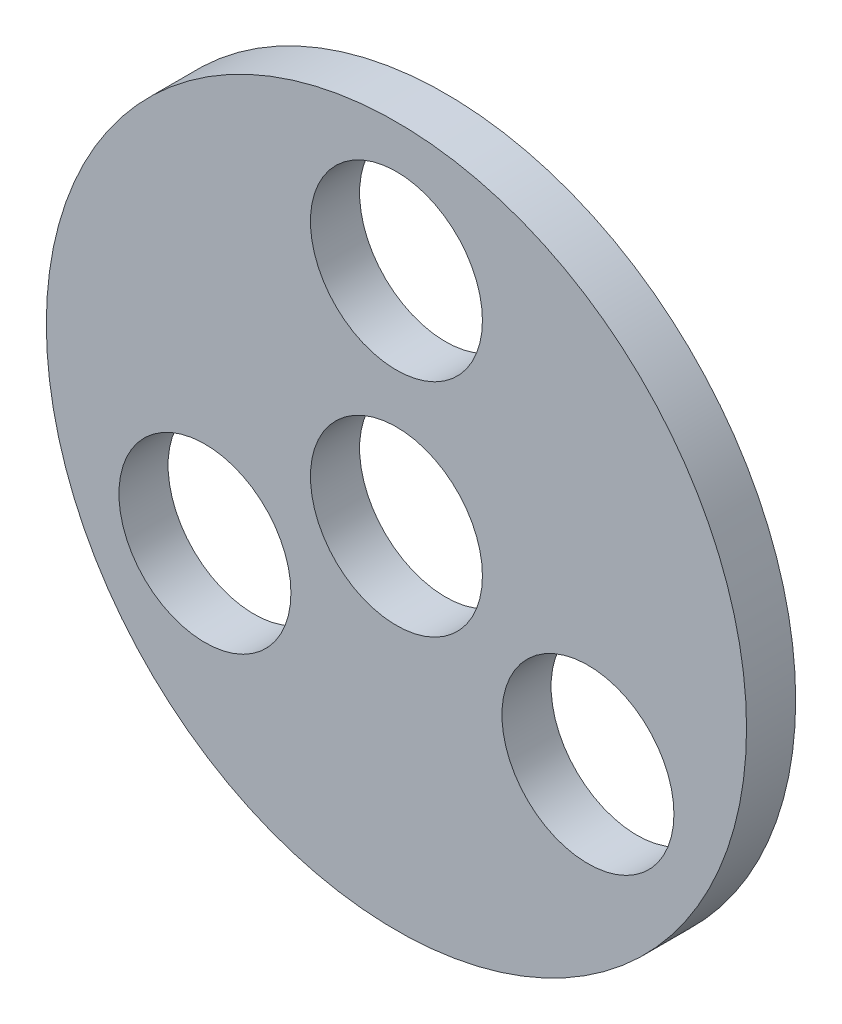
ISO-10303-21;
HEADER;
FILE_DESCRIPTION(('STEP AP214'),'2;1');
FILE_NAME('part.step','',(''),(''),'','','');
FILE_SCHEMA(('AUTOMOTIVE_DESIGN { 1 0 10303 214 1 1 1 1 }'));
ENDSEC;
DATA;
#1=APPLICATION_CONTEXT('core data for automotive mechanical design processes');
#2=APPLICATION_PROTOCOL_DEFINITION('international standard','automotive_design',2000,#1);
#3=PRODUCT_CONTEXT('',#1,'mechanical');
#4=PRODUCT('Part','Part','',(#3));
#5=PRODUCT_RELATED_PRODUCT_CATEGORY('part','',(#4));
#6=PRODUCT_DEFINITION_FORMATION('','',#4);
#7=PRODUCT_DEFINITION_CONTEXT('part definition',#1,'design');
#8=PRODUCT_DEFINITION('design','',#6,#7);
#9=PRODUCT_DEFINITION_SHAPE('','',#8);
#10=(LENGTH_UNIT() NAMED_UNIT(*) SI_UNIT(.MILLI.,.METRE.));
#11=(NAMED_UNIT(*) PLANE_ANGLE_UNIT() SI_UNIT($,.RADIAN.));
#12=(NAMED_UNIT(*) SI_UNIT($,.STERADIAN.) SOLID_ANGLE_UNIT());
#13=UNCERTAINTY_MEASURE_WITH_UNIT(LENGTH_MEASURE(1.E-05),#10,'distance_accuracy_value','');
#14=(GEOMETRIC_REPRESENTATION_CONTEXT(3) GLOBAL_UNCERTAINTY_ASSIGNED_CONTEXT((#13)) GLOBAL_UNIT_ASSIGNED_CONTEXT((#10,
#11,#12)) REPRESENTATION_CONTEXT('',''));
#15=CARTESIAN_POINT('',(0.,0.,0.));
#16=DIRECTION('',(0.,0.,1.));
#17=DIRECTION('',(1.,0.,0.));
#18=AXIS2_PLACEMENT_3D('',#15,#16,#17);
#19=CARTESIAN_POINT('',(0.,0.,2.));
#20=DIRECTION('',(0.,0.,1.));
#21=DIRECTION('',(1.,0.,0.));
#22=AXIS2_PLACEMENT_3D('',#19,#20,#21);
#23=PLANE('',#22);
#24=CARTESIAN_POINT('',(7.79422863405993,-4.50000000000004,2.));
#25=DIRECTION('',(0.,0.,1.));
#26=DIRECTION('',(1.,0.,0.));
#27=AXIS2_PLACEMENT_3D('',#24,#25,#26);
#28=CIRCLE('',#27,3.5);
#29=CARTESIAN_POINT('',(11.2942286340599,-4.50000000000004,2.));
#30=VERTEX_POINT('',#29);
#31=EDGE_CURVE('E53',#30,#30,#28,.T.);
#32=ORIENTED_EDGE('',*,*,#31,.F.);
#33=EDGE_LOOP('',(#32));
#34=FACE_BOUND('',#33,.T.);
#35=CARTESIAN_POINT('',(0.,9.,2.));
#36=DIRECTION('',(0.,0.,1.));
#37=DIRECTION('',(1.,0.,0.));
#38=AXIS2_PLACEMENT_3D('',#35,#36,#37);
#39=CIRCLE('',#38,3.5);
#40=CARTESIAN_POINT('',(3.5,9.,2.));
#41=VERTEX_POINT('',#40);
#42=EDGE_CURVE('E38',#41,#41,#39,.T.);
#43=ORIENTED_EDGE('',*,*,#42,.F.);
#44=EDGE_LOOP('',(#43));
#45=FACE_BOUND('',#44,.T.);
#46=CARTESIAN_POINT('',(0.,0.,2.));
#47=DIRECTION('',(0.,0.,1.));
#48=DIRECTION('',(1.,0.,0.));
#49=AXIS2_PLACEMENT_3D('',#46,#47,#48);
#50=CIRCLE('',#49,14.25);
#51=CARTESIAN_POINT('',(14.25,0.,2.));
#52=VERTEX_POINT('',#51);
#53=EDGE_CURVE('E10',#52,#52,#50,.T.);
#54=ORIENTED_EDGE('',*,*,#53,.T.);
#55=EDGE_LOOP('',(#54));
#56=FACE_BOUND('',#55,.T.);
#57=CARTESIAN_POINT('',(0.,0.,2.));
#58=DIRECTION('',(0.,0.,1.));
#59=DIRECTION('',(1.,0.,0.));
#60=AXIS2_PLACEMENT_3D('',#57,#58,#59);
#61=CIRCLE('',#60,3.5);
#62=CARTESIAN_POINT('',(3.5,0.,2.));
#63=VERTEX_POINT('',#62);
#64=EDGE_CURVE('E47',#63,#63,#61,.T.);
#65=ORIENTED_EDGE('',*,*,#64,.F.);
#66=EDGE_LOOP('',(#65));
#67=FACE_BOUND('',#66,.T.);
#68=CARTESIAN_POINT('',(-7.79422863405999,-4.49999999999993,2.));
#69=DIRECTION('',(0.,0.,1.));
#70=DIRECTION('',(1.,0.,0.));
#71=AXIS2_PLACEMENT_3D('',#68,#69,#70);
#72=CIRCLE('',#71,3.5);
#73=CARTESIAN_POINT('',(-4.29422863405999,-4.49999999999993,2.));
#74=VERTEX_POINT('',#73);
#75=EDGE_CURVE('E59',#74,#74,#72,.T.);
#76=ORIENTED_EDGE('',*,*,#75,.F.);
#77=EDGE_LOOP('',(#76));
#78=FACE_BOUND('',#77,.T.);
#79=ADVANCED_FACE('F27',(#34,#45,#56,#67,#78),#23,.T.);
#80=CARTESIAN_POINT('',(0.,0.,0.));
#81=DIRECTION('',(0.,0.,1.));
#82=DIRECTION('',(1.,0.,0.));
#83=AXIS2_PLACEMENT_3D('',#80,#81,#82);
#84=PLANE('',#83);
#85=CARTESIAN_POINT('',(7.79422863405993,-4.50000000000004,0.));
#86=DIRECTION('',(0.,0.,1.));
#87=DIRECTION('',(1.,0.,0.));
#88=AXIS2_PLACEMENT_3D('',#85,#86,#87);
#89=CIRCLE('',#88,3.5);
#90=CARTESIAN_POINT('',(11.2942286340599,-4.50000000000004,0.));
#91=VERTEX_POINT('',#90);
#92=EDGE_CURVE('E56',#91,#91,#89,.T.);
#93=ORIENTED_EDGE('',*,*,#92,.T.);
#94=EDGE_LOOP('',(#93));
#95=FACE_BOUND('',#94,.T.);
#96=CARTESIAN_POINT('',(0.,9.,0.));
#97=DIRECTION('',(0.,0.,1.));
#98=DIRECTION('',(1.,0.,0.));
#99=AXIS2_PLACEMENT_3D('',#96,#97,#98);
#100=CIRCLE('',#99,3.5);
#101=CARTESIAN_POINT('',(3.5,9.,0.));
#102=VERTEX_POINT('',#101);
#103=EDGE_CURVE('E42',#102,#102,#100,.T.);
#104=ORIENTED_EDGE('',*,*,#103,.T.);
#105=EDGE_LOOP('',(#104));
#106=FACE_BOUND('',#105,.T.);
#107=CARTESIAN_POINT('',(0.,0.,0.));
#108=DIRECTION('',(0.,0.,1.));
#109=DIRECTION('',(1.,0.,0.));
#110=AXIS2_PLACEMENT_3D('',#107,#108,#109);
#111=CIRCLE('',#110,14.25);
#112=CARTESIAN_POINT('',(14.25,0.,0.));
#113=VERTEX_POINT('',#112);
#114=EDGE_CURVE('E34',#113,#113,#111,.T.);
#115=ORIENTED_EDGE('',*,*,#114,.F.);
#116=EDGE_LOOP('',(#115));
#117=FACE_BOUND('',#116,.T.);
#118=CARTESIAN_POINT('',(0.,0.,0.));
#119=DIRECTION('',(0.,0.,1.));
#120=DIRECTION('',(1.,0.,0.));
#121=AXIS2_PLACEMENT_3D('',#118,#119,#120);
#122=CIRCLE('',#121,3.5);
#123=CARTESIAN_POINT('',(3.5,0.,0.));
#124=VERTEX_POINT('',#123);
#125=EDGE_CURVE('E50',#124,#124,#122,.T.);
#126=ORIENTED_EDGE('',*,*,#125,.T.);
#127=EDGE_LOOP('',(#126));
#128=FACE_BOUND('',#127,.T.);
#129=CARTESIAN_POINT('',(-7.79422863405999,-4.49999999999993,0.));
#130=DIRECTION('',(0.,0.,1.));
#131=DIRECTION('',(1.,0.,0.));
#132=AXIS2_PLACEMENT_3D('',#129,#130,#131);
#133=CIRCLE('',#132,3.5);
#134=CARTESIAN_POINT('',(-4.29422863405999,-4.49999999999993,0.));
#135=VERTEX_POINT('',#134);
#136=EDGE_CURVE('E62',#135,#135,#133,.T.);
#137=ORIENTED_EDGE('',*,*,#136,.T.);
#138=EDGE_LOOP('',(#137));
#139=FACE_BOUND('',#138,.T.);
#140=ADVANCED_FACE('F66',(#95,#106,#117,#128,#139),#84,.F.);
#141=CARTESIAN_POINT('',(0.,0.,2.));
#142=DIRECTION('',(0.,0.,-1.));
#143=DIRECTION('',(-1.,0.,0.));
#144=AXIS2_PLACEMENT_3D('',#141,#142,#143);
#145=CYLINDRICAL_SURFACE('',#144,14.25);
#146=ORIENTED_EDGE('',*,*,#53,.F.);
#147=EDGE_LOOP('',(#146));
#148=FACE_BOUND('',#147,.T.);
#149=ORIENTED_EDGE('',*,*,#114,.T.);
#150=EDGE_LOOP('',(#149));
#151=FACE_BOUND('',#150,.T.);
#152=ADVANCED_FACE('F29',(#148,#151),#145,.T.);
#153=CARTESIAN_POINT('',(0.,9.,2.));
#154=DIRECTION('',(0.,0.,-1.));
#155=DIRECTION('',(-1.,0.,0.));
#156=AXIS2_PLACEMENT_3D('',#153,#154,#155);
#157=CYLINDRICAL_SURFACE('',#156,3.5);
#158=ORIENTED_EDGE('',*,*,#42,.T.);
#159=EDGE_LOOP('',(#158));
#160=FACE_BOUND('',#159,.T.);
#161=ORIENTED_EDGE('',*,*,#103,.F.);
#162=EDGE_LOOP('',(#161));
#163=FACE_BOUND('',#162,.T.);
#164=ADVANCED_FACE('F89',(#160,#163),#157,.F.);
#165=CARTESIAN_POINT('',(0.,0.,2.));
#166=DIRECTION('',(0.,0.,-1.));
#167=DIRECTION('',(-1.,0.,0.));
#168=AXIS2_PLACEMENT_3D('',#165,#166,#167);
#169=CYLINDRICAL_SURFACE('',#168,3.5);
#170=ORIENTED_EDGE('',*,*,#64,.T.);
#171=EDGE_LOOP('',(#170));
#172=FACE_BOUND('',#171,.T.);
#173=ORIENTED_EDGE('',*,*,#125,.F.);
#174=EDGE_LOOP('',(#173));
#175=FACE_BOUND('',#174,.T.);
#176=ADVANCED_FACE('F76',(#172,#175),#169,.F.);
#177=CARTESIAN_POINT('',(7.79422863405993,-4.50000000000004,2.));
#178=DIRECTION('',(0.,0.,-1.));
#179=DIRECTION('',(-1.,0.,0.));
#180=AXIS2_PLACEMENT_3D('',#177,#178,#179);
#181=CYLINDRICAL_SURFACE('',#180,3.5);
#182=ORIENTED_EDGE('',*,*,#31,.T.);
#183=EDGE_LOOP('',(#182));
#184=FACE_BOUND('',#183,.T.);
#185=ORIENTED_EDGE('',*,*,#92,.F.);
#186=EDGE_LOOP('',(#185));
#187=FACE_BOUND('',#186,.T.);
#188=ADVANCED_FACE('F70',(#184,#187),#181,.F.);
#189=CARTESIAN_POINT('',(-7.79422863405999,-4.49999999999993,2.));
#190=DIRECTION('',(0.,0.,-1.));
#191=DIRECTION('',(-1.,0.,0.));
#192=AXIS2_PLACEMENT_3D('',#189,#190,#191);
#193=CYLINDRICAL_SURFACE('',#192,3.5);
#194=ORIENTED_EDGE('',*,*,#75,.T.);
#195=EDGE_LOOP('',(#194));
#196=FACE_BOUND('',#195,.T.);
#197=ORIENTED_EDGE('',*,*,#136,.F.);
#198=EDGE_LOOP('',(#197));
#199=FACE_BOUND('',#198,.T.);
#200=ADVANCED_FACE('F68',(#196,#199),#193,.F.);
#201=CLOSED_SHELL('',(#79,#140,#152,#164,#176,#188,#200));
#202=MANIFOLD_SOLID_BREP('B2',#201);
#203=ADVANCED_BREP_SHAPE_REPRESENTATION('',(#18,#202),#14);
#204=SHAPE_DEFINITION_REPRESENTATION(#9,#203);
ENDSEC;
END-ISO-10303-21;
